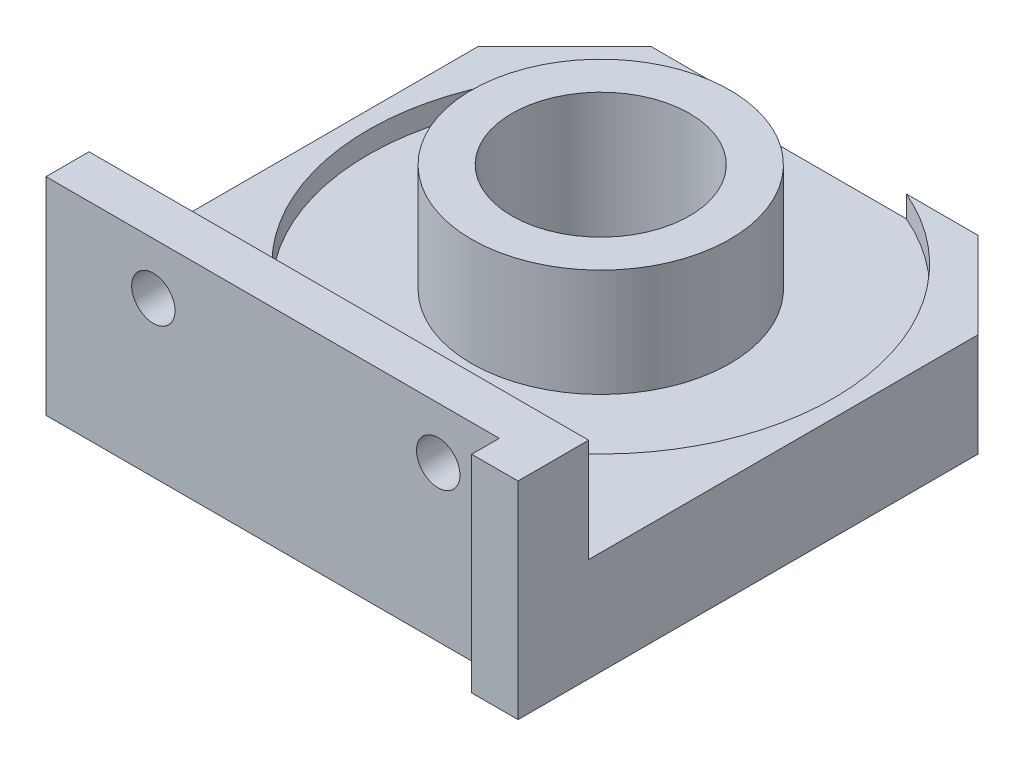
ISO-10303-21;
HEADER;
FILE_DESCRIPTION(('STEP AP214'),'2;1');
FILE_NAME('part.step','',(''),(''),'','','');
FILE_SCHEMA(('AUTOMOTIVE_DESIGN { 1 0 10303 214 1 1 1 1 }'));
ENDSEC;
DATA;
#1=APPLICATION_CONTEXT('core data for automotive mechanical design processes');
#2=APPLICATION_PROTOCOL_DEFINITION('international standard','automotive_design',2000,#1);
#3=PRODUCT_CONTEXT('',#1,'mechanical');
#4=PRODUCT('Part','Part','',(#3));
#5=PRODUCT_RELATED_PRODUCT_CATEGORY('part','',(#4));
#6=PRODUCT_DEFINITION_FORMATION('','',#4);
#7=PRODUCT_DEFINITION_CONTEXT('part definition',#1,'design');
#8=PRODUCT_DEFINITION('design','',#6,#7);
#9=PRODUCT_DEFINITION_SHAPE('','',#8);
#10=(LENGTH_UNIT() NAMED_UNIT(*) SI_UNIT(.MILLI.,.METRE.));
#11=(NAMED_UNIT(*) PLANE_ANGLE_UNIT() SI_UNIT($,.RADIAN.));
#12=(NAMED_UNIT(*) SI_UNIT($,.STERADIAN.) SOLID_ANGLE_UNIT());
#13=UNCERTAINTY_MEASURE_WITH_UNIT(LENGTH_MEASURE(1.E-05),#10,'distance_accuracy_value','');
#14=(GEOMETRIC_REPRESENTATION_CONTEXT(3) GLOBAL_UNCERTAINTY_ASSIGNED_CONTEXT((#13)) GLOBAL_UNIT_ASSIGNED_CONTEXT((#10,
#11,#12)) REPRESENTATION_CONTEXT('',''));
#15=CARTESIAN_POINT('',(0.,0.,0.));
#16=DIRECTION('',(0.,0.,1.));
#17=DIRECTION('',(1.,0.,0.));
#18=AXIS2_PLACEMENT_3D('',#15,#16,#17);
#19=CARTESIAN_POINT('',(0.,-7.62,0.));
#20=DIRECTION('',(0.,1.,0.));
#21=DIRECTION('',(0.,0.,1.));
#22=AXIS2_PLACEMENT_3D('',#19,#20,#21);
#23=PLANE('',#22);
#24=DIRECTION('',(-1.,0.,0.));
#25=VECTOR('',#24,1.);
#26=CARTESIAN_POINT('',(0.,-7.62,-38.227));
#27=LINE('',#26,#25);
#28=CARTESIAN_POINT('',(-6.35000000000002,-7.62,-38.227));
#29=VERTEX_POINT('',#28);
#30=CARTESIAN_POINT('',(-30.48,-7.62,-38.227));
#31=VERTEX_POINT('',#30);
#32=EDGE_CURVE('E307',#29,#31,#27,.T.);
#33=ORIENTED_EDGE('',*,*,#32,.F.);
#34=DIRECTION('',(-0.707106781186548,0.,-0.707106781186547));
#35=VECTOR('',#34,1.);
#36=CARTESIAN_POINT('',(0.,-7.62,-31.877));
#37=LINE('',#36,#35);
#38=CARTESIAN_POINT('',(0.,-7.62,-31.877));
#39=VERTEX_POINT('',#38);
#40=EDGE_CURVE('E205',#29,#39,#37,.F.);
#41=ORIENTED_EDGE('',*,*,#40,.T.);
#42=DIRECTION('',(0.,0.,-1.));
#43=VECTOR('',#42,1.);
#44=CARTESIAN_POINT('',(0.,-7.62,0.));
#45=LINE('',#44,#43);
#46=CARTESIAN_POINT('',(0.,-7.62,2.032));
#47=VERTEX_POINT('',#46);
#48=EDGE_CURVE('E174',#47,#39,#45,.T.);
#49=ORIENTED_EDGE('',*,*,#48,.F.);
#50=DIRECTION('',(1.,0.,0.));
#51=VECTOR('',#50,1.);
#52=CARTESIAN_POINT('',(0.,-7.62,2.032));
#53=LINE('',#52,#51);
#54=CARTESIAN_POINT('',(-3.415,-7.62,2.032));
#55=VERTEX_POINT('',#54);
#56=EDGE_CURVE('E262',#55,#47,#53,.T.);
#57=ORIENTED_EDGE('',*,*,#56,.F.);
#58=DIRECTION('',(0.,0.,-1.));
#59=VECTOR('',#58,1.);
#60=CARTESIAN_POINT('',(-3.415,-7.62,2.032));
#61=LINE('',#60,#59);
#62=CARTESIAN_POINT('',(-3.415,-7.62,0.));
#63=VERTEX_POINT('',#62);
#64=EDGE_CURVE('E265',#55,#63,#61,.T.);
#65=ORIENTED_EDGE('',*,*,#64,.T.);
#66=DIRECTION('',(1.,0.,0.));
#67=VECTOR('',#66,1.);
#68=CARTESIAN_POINT('',(0.,-7.62,0.));
#69=LINE('',#68,#67);
#70=CARTESIAN_POINT('',(-36.83,-7.62,0.));
#71=VERTEX_POINT('',#70);
#72=EDGE_CURVE('E274',#71,#63,#69,.T.);
#73=ORIENTED_EDGE('',*,*,#72,.F.);
#74=DIRECTION('',(0.,0.,1.));
#75=VECTOR('',#74,1.);
#76=CARTESIAN_POINT('',(-36.83,-7.62,0.));
#77=LINE('',#76,#75);
#78=CARTESIAN_POINT('',(-36.83,-7.62,-31.8769999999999));
#79=VERTEX_POINT('',#78);
#80=EDGE_CURVE('E311',#79,#71,#77,.T.);
#81=ORIENTED_EDGE('',*,*,#80,.F.);
#82=DIRECTION('',(-0.707106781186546,0.,0.707106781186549));
#83=VECTOR('',#82,1.);
#84=CARTESIAN_POINT('',(-30.48,-7.62,-38.227));
#85=LINE('',#84,#83);
#86=EDGE_CURVE('E202',#79,#31,#85,.F.);
#87=ORIENTED_EDGE('',*,*,#86,.T.);
#88=EDGE_LOOP('',(#33,#41,#49,#57,#65,#73,#81,#87));
#89=FACE_BOUND('',#88,.T.);
#90=CARTESIAN_POINT('',(-18.415,-7.62,-22.48));
#91=DIRECTION('',(0.,1.,0.));
#92=DIRECTION('',(0.,0.,1.));
#93=AXIS2_PLACEMENT_3D('',#90,#91,#92);
#94=CIRCLE('',#93,10.795);
#95=CARTESIAN_POINT('',(-18.415,-7.62,-11.685));
#96=VERTEX_POINT('',#95);
#97=EDGE_CURVE('E209',#96,#96,#94,.F.);
#98=ORIENTED_EDGE('',*,*,#97,.F.);
#99=EDGE_LOOP('',(#98));
#100=FACE_BOUND('',#99,.T.);
#101=ADVANCED_FACE('F46',(#89,#100),#23,.F.);
#102=CARTESIAN_POINT('',(0.,0.,0.));
#103=DIRECTION('',(0.,1.,0.));
#104=DIRECTION('',(0.,0.,1.));
#105=AXIS2_PLACEMENT_3D('',#102,#103,#104);
#106=PLANE('',#105);
#107=CARTESIAN_POINT('',(-18.415,0.,-22.48));
#108=DIRECTION('',(0.,1.,0.));
#109=DIRECTION('',(0.,0.,1.));
#110=AXIS2_PLACEMENT_3D('',#107,#108,#109);
#111=CIRCLE('',#110,17.145);
#112=CARTESIAN_POINT('',(-25.1960777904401,0.,-38.227));
#113=VERTEX_POINT('',#112);
#114=CARTESIAN_POINT('',(-11.6339222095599,0.,-38.227));
#115=VERTEX_POINT('',#114);
#116=EDGE_CURVE('E147',#113,#115,#111,.T.);
#117=ORIENTED_EDGE('',*,*,#116,.F.);
#118=DIRECTION('',(-1.,0.,0.));
#119=VECTOR('',#118,1.);
#120=CARTESIAN_POINT('',(0.,0.,-38.227));
#121=LINE('',#120,#119);
#122=CARTESIAN_POINT('',(-30.48,0.,-38.227));
#123=VERTEX_POINT('',#122);
#124=EDGE_CURVE('E170',#113,#123,#121,.T.);
#125=ORIENTED_EDGE('',*,*,#124,.T.);
#126=DIRECTION('',(0.707106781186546,0.,-0.707106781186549));
#127=VECTOR('',#126,1.);
#128=CARTESIAN_POINT('',(-34.3535000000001,0.,-34.3534999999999));
#129=LINE('',#128,#127);
#130=CARTESIAN_POINT('',(-36.83,0.,-31.877));
#131=VERTEX_POINT('',#130);
#132=EDGE_CURVE('E190',#123,#131,#129,.F.);
#133=ORIENTED_EDGE('',*,*,#132,.T.);
#134=DIRECTION('',(0.,0.,1.));
#135=VECTOR('',#134,1.);
#136=CARTESIAN_POINT('',(-36.83,0.,0.));
#137=LINE('',#136,#135);
#138=CARTESIAN_POINT('',(-36.83,0.,-3.175));
#139=VERTEX_POINT('',#138);
#140=EDGE_CURVE('E169',#131,#139,#137,.T.);
#141=ORIENTED_EDGE('',*,*,#140,.T.);
#142=DIRECTION('',(-1.,0.,0.));
#143=VECTOR('',#142,1.);
#144=CARTESIAN_POINT('',(0.,0.,-3.175));
#145=LINE('',#144,#143);
#146=CARTESIAN_POINT('',(0.,0.,-3.175));
#147=VERTEX_POINT('',#146);
#148=EDGE_CURVE('E282',#147,#139,#145,.T.);
#149=ORIENTED_EDGE('',*,*,#148,.F.);
#150=DIRECTION('',(0.,0.,-1.));
#151=VECTOR('',#150,1.);
#152=CARTESIAN_POINT('',(0.,0.,0.));
#153=LINE('',#152,#151);
#154=CARTESIAN_POINT('',(0.,0.,-31.877));
#155=VERTEX_POINT('',#154);
#156=EDGE_CURVE('E177',#147,#155,#153,.T.);
#157=ORIENTED_EDGE('',*,*,#156,.T.);
#158=DIRECTION('',(0.707106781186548,0.,0.707106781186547));
#159=VECTOR('',#158,1.);
#160=CARTESIAN_POINT('',(15.9385,0.,-15.9385));
#161=LINE('',#160,#159);
#162=CARTESIAN_POINT('',(-6.35000000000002,0.,-38.227));
#163=VERTEX_POINT('',#162);
#164=EDGE_CURVE('E167',#155,#163,#161,.F.);
#165=ORIENTED_EDGE('',*,*,#164,.T.);
#166=EDGE_CURVE('E161',#163,#115,#121,.T.);
#167=ORIENTED_EDGE('',*,*,#166,.T.);
#168=EDGE_LOOP('',(#117,#125,#133,#141,#149,#157,#165,#167));
#169=FACE_BOUND('',#168,.T.);
#170=ADVANCED_FACE('F165',(#169),#106,.T.);
#171=CARTESIAN_POINT('',(0.,-7.62,0.));
#172=DIRECTION('',(1.,0.,0.));
#173=DIRECTION('',(0.,0.,-1.));
#174=AXIS2_PLACEMENT_3D('',#171,#172,#173);
#175=PLANE('',#174);
#176=ORIENTED_EDGE('',*,*,#48,.T.);
#177=DIRECTION('',(0.,1.,0.));
#178=VECTOR('',#177,1.);
#179=CARTESIAN_POINT('',(0.,-7.62,-31.877));
#180=LINE('',#179,#178);
#181=EDGE_CURVE('E188',#39,#155,#180,.T.);
#182=ORIENTED_EDGE('',*,*,#181,.T.);
#183=ORIENTED_EDGE('',*,*,#156,.F.);
#184=DIRECTION('',(0.,-1.,0.));
#185=VECTOR('',#184,1.);
#186=CARTESIAN_POINT('',(0.,7.62,-3.175));
#187=LINE('',#186,#185);
#188=CARTESIAN_POINT('',(0.,7.62,-3.175));
#189=VERTEX_POINT('',#188);
#190=EDGE_CURVE('E330',#189,#147,#187,.T.);
#191=ORIENTED_EDGE('',*,*,#190,.F.);
#192=DIRECTION('',(0.,0.,-1.));
#193=VECTOR('',#192,1.);
#194=CARTESIAN_POINT('',(0.,7.62,0.));
#195=LINE('',#194,#193);
#196=CARTESIAN_POINT('',(0.,7.62,2.032));
#197=VERTEX_POINT('',#196);
#198=EDGE_CURVE('E268',#197,#189,#195,.T.);
#199=ORIENTED_EDGE('',*,*,#198,.F.);
#200=DIRECTION('',(0.,1.,0.));
#201=VECTOR('',#200,1.);
#202=CARTESIAN_POINT('',(0.,7.62,2.032));
#203=LINE('',#202,#201);
#204=EDGE_CURVE('E255',#47,#197,#203,.T.);
#205=ORIENTED_EDGE('',*,*,#204,.F.);
#206=EDGE_LOOP('',(#176,#182,#183,#191,#199,#205));
#207=FACE_BOUND('',#206,.T.);
#208=ADVANCED_FACE('F325',(#207),#175,.T.);
#209=CARTESIAN_POINT('',(0.,-7.62,0.));
#210=DIRECTION('',(0.,0.,1.));
#211=DIRECTION('',(1.,0.,0.));
#212=AXIS2_PLACEMENT_3D('',#209,#210,#211);
#213=PLANE('',#212);
#214=CARTESIAN_POINT('',(-28.915,3.81,0.));
#215=DIRECTION('',(0.,0.,1.));
#216=DIRECTION('',(1.,0.,0.));
#217=AXIS2_PLACEMENT_3D('',#214,#215,#216);
#218=CIRCLE('',#217,1.59999999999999);
#219=CARTESIAN_POINT('',(-27.315,3.81,0.));
#220=VERTEX_POINT('',#219);
#221=EDGE_CURVE('E235',#220,#220,#218,.T.);
#222=ORIENTED_EDGE('',*,*,#221,.F.);
#223=EDGE_LOOP('',(#222));
#224=FACE_BOUND('',#223,.T.);
#225=CARTESIAN_POINT('',(-7.915,3.81,0.));
#226=DIRECTION('',(0.,0.,1.));
#227=DIRECTION('',(1.,0.,0.));
#228=AXIS2_PLACEMENT_3D('',#225,#226,#227);
#229=CIRCLE('',#228,1.59999999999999);
#230=CARTESIAN_POINT('',(-6.31500000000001,3.81,0.));
#231=VERTEX_POINT('',#230);
#232=EDGE_CURVE('E242',#231,#231,#229,.T.);
#233=ORIENTED_EDGE('',*,*,#232,.F.);
#234=EDGE_LOOP('',(#233));
#235=FACE_BOUND('',#234,.T.);
#236=DIRECTION('',(0.,-1.,0.));
#237=VECTOR('',#236,1.);
#238=CARTESIAN_POINT('',(-3.415,7.62,0.));
#239=LINE('',#238,#237);
#240=CARTESIAN_POINT('',(-3.415,7.62,0.));
#241=VERTEX_POINT('',#240);
#242=EDGE_CURVE('E254',#241,#63,#239,.T.);
#243=ORIENTED_EDGE('',*,*,#242,.F.);
#244=DIRECTION('',(1.,0.,0.));
#245=VECTOR('',#244,1.);
#246=CARTESIAN_POINT('',(0.,7.62,0.));
#247=LINE('',#246,#245);
#248=CARTESIAN_POINT('',(-36.83,7.62,0.));
#249=VERTEX_POINT('',#248);
#250=EDGE_CURVE('E333',#249,#241,#247,.T.);
#251=ORIENTED_EDGE('',*,*,#250,.F.);
#252=DIRECTION('',(0.,1.,0.));
#253=VECTOR('',#252,1.);
#254=CARTESIAN_POINT('',(-36.83,-7.62,0.));
#255=LINE('',#254,#253);
#256=EDGE_CURVE('E184',#71,#249,#255,.T.);
#257=ORIENTED_EDGE('',*,*,#256,.F.);
#258=ORIENTED_EDGE('',*,*,#72,.T.);
#259=EDGE_LOOP('',(#243,#251,#257,#258));
#260=FACE_BOUND('',#259,.T.);
#261=ADVANCED_FACE('F349',(#224,#235,#260),#213,.T.);
#262=CARTESIAN_POINT('',(-36.83,-7.62,0.));
#263=DIRECTION('',(-1.,0.,0.));
#264=DIRECTION('',(0.,0.,1.));
#265=AXIS2_PLACEMENT_3D('',#262,#263,#264);
#266=PLANE('',#265);
#267=CARTESIAN_POINT('',(-36.83,-3.81,-7.42949999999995));
#268=DIRECTION('',(-1.,0.,0.));
#269=DIRECTION('',(0.,0.,1.));
#270=AXIS2_PLACEMENT_3D('',#267,#268,#269);
#271=CIRCLE('',#270,1.25);
#272=CARTESIAN_POINT('',(-36.83,-3.81,-6.17949999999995));
#273=VERTEX_POINT('',#272);
#274=EDGE_CURVE('E214',#273,#273,#271,.T.);
#275=ORIENTED_EDGE('',*,*,#274,.F.);
#276=EDGE_LOOP('',(#275));
#277=FACE_BOUND('',#276,.T.);
#278=CARTESIAN_POINT('',(-36.83,-3.81,-26.4794999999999));
#279=DIRECTION('',(-1.,0.,0.));
#280=DIRECTION('',(0.,0.,1.));
#281=AXIS2_PLACEMENT_3D('',#278,#279,#280);
#282=CIRCLE('',#281,1.25);
#283=CARTESIAN_POINT('',(-36.83,-3.81,-25.2294999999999));
#284=VERTEX_POINT('',#283);
#285=EDGE_CURVE('E225',#284,#284,#282,.T.);
#286=ORIENTED_EDGE('',*,*,#285,.F.);
#287=EDGE_LOOP('',(#286));
#288=FACE_BOUND('',#287,.T.);
#289=ORIENTED_EDGE('',*,*,#140,.F.);
#290=DIRECTION('',(0.,-1.,0.));
#291=VECTOR('',#290,1.);
#292=CARTESIAN_POINT('',(-36.83,-7.62,-31.877));
#293=LINE('',#292,#291);
#294=EDGE_CURVE('E72',#131,#79,#293,.T.);
#295=ORIENTED_EDGE('',*,*,#294,.T.);
#296=ORIENTED_EDGE('',*,*,#80,.T.);
#297=ORIENTED_EDGE('',*,*,#256,.T.);
#298=DIRECTION('',(0.,0.,1.));
#299=VECTOR('',#298,1.);
#300=CARTESIAN_POINT('',(-36.83,7.62,0.));
#301=LINE('',#300,#299);
#302=CARTESIAN_POINT('',(-36.83,7.62,-3.175));
#303=VERTEX_POINT('',#302);
#304=EDGE_CURVE('E339',#303,#249,#301,.T.);
#305=ORIENTED_EDGE('',*,*,#304,.F.);
#306=DIRECTION('',(0.,-1.,0.));
#307=VECTOR('',#306,1.);
#308=CARTESIAN_POINT('',(-36.83,7.62,-3.175));
#309=LINE('',#308,#307);
#310=EDGE_CURVE('E298',#303,#139,#309,.T.);
#311=ORIENTED_EDGE('',*,*,#310,.T.);
#312=EDGE_LOOP('',(#289,#295,#296,#297,#305,#311));
#313=FACE_BOUND('',#312,.T.);
#314=ADVANCED_FACE('F347',(#277,#288,#313),#266,.T.);
#315=CARTESIAN_POINT('',(0.,-7.62,-38.227));
#316=DIRECTION('',(0.,0.,-1.));
#317=DIRECTION('',(-1.,0.,0.));
#318=AXIS2_PLACEMENT_3D('',#315,#316,#317);
#319=PLANE('',#318);
#320=DIRECTION('',(0.,1.,0.));
#321=VECTOR('',#320,1.);
#322=CARTESIAN_POINT('',(-25.1960777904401,-1.5875,-38.227));
#323=LINE('',#322,#321);
#324=CARTESIAN_POINT('',(-25.1960777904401,-1.5875,-38.227));
#325=VERTEX_POINT('',#324);
#326=EDGE_CURVE('E11',#325,#113,#323,.T.);
#327=ORIENTED_EDGE('',*,*,#326,.F.);
#328=DIRECTION('',(1.,0.,0.));
#329=VECTOR('',#328,1.);
#330=CARTESIAN_POINT('',(0.,-1.5875,-38.227));
#331=LINE('',#330,#329);
#332=CARTESIAN_POINT('',(-11.6339222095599,-1.5875,-38.227));
#333=VERTEX_POINT('',#332);
#334=EDGE_CURVE('E163',#325,#333,#331,.T.);
#335=ORIENTED_EDGE('',*,*,#334,.T.);
#336=DIRECTION('',(0.,1.,0.));
#337=VECTOR('',#336,1.);
#338=CARTESIAN_POINT('',(-11.6339222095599,-1.5875,-38.227));
#339=LINE('',#338,#337);
#340=EDGE_CURVE('E55',#115,#333,#339,.F.);
#341=ORIENTED_EDGE('',*,*,#340,.F.);
#342=ORIENTED_EDGE('',*,*,#166,.F.);
#343=DIRECTION('',(0.,-1.,0.));
#344=VECTOR('',#343,1.);
#345=CARTESIAN_POINT('',(-6.35000000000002,-7.62,-38.227));
#346=LINE('',#345,#344);
#347=EDGE_CURVE('E199',#163,#29,#346,.T.);
#348=ORIENTED_EDGE('',*,*,#347,.T.);
#349=ORIENTED_EDGE('',*,*,#32,.T.);
#350=DIRECTION('',(0.,1.,0.));
#351=VECTOR('',#350,1.);
#352=CARTESIAN_POINT('',(-30.48,-7.62,-38.227));
#353=LINE('',#352,#351);
#354=EDGE_CURVE('E195',#31,#123,#353,.T.);
#355=ORIENTED_EDGE('',*,*,#354,.T.);
#356=ORIENTED_EDGE('',*,*,#124,.F.);
#357=EDGE_LOOP('',(#327,#335,#341,#342,#348,#349,#355,#356));
#358=FACE_BOUND('',#357,.T.);
#359=ADVANCED_FACE('F160',(#358),#319,.T.);
#360=ORIENTED_EDGE('',*,*,#97,.T.);
#361=EDGE_LOOP('',(#360));
#362=FACE_BOUND('',#361,.T.);
#363=CARTESIAN_POINT('',(-18.415,-7.62,-22.48));
#364=DIRECTION('',(0.,1.,0.));
#365=DIRECTION('',(0.,0.,1.));
#366=AXIS2_PLACEMENT_3D('',#363,#364,#365);
#367=CIRCLE('',#366,6.54811999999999);
#368=CARTESIAN_POINT('',(-18.415,-7.62,-15.93188));
#369=VERTEX_POINT('',#368);
#370=EDGE_CURVE('E248',#369,#369,#367,.T.);
#371=ORIENTED_EDGE('',*,*,#370,.T.);
#372=EDGE_LOOP('',(#371));
#373=FACE_BOUND('',#372,.T.);
#374=ADVANCED_FACE('F356',(#362,#373),#23,.F.);
#375=CARTESIAN_POINT('',(0.,7.62,-3.175));
#376=DIRECTION('',(0.,0.,1.));
#377=DIRECTION('',(1.,0.,0.));
#378=AXIS2_PLACEMENT_3D('',#375,#376,#377);
#379=PLANE('',#378);
#380=CARTESIAN_POINT('',(-28.915,3.81,-3.175));
#381=DIRECTION('',(0.,0.,-1.));
#382=DIRECTION('',(-1.,0.,0.));
#383=AXIS2_PLACEMENT_3D('',#380,#381,#382);
#384=CIRCLE('',#383,1.59999999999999);
#385=CARTESIAN_POINT('',(-30.515,3.81,-3.175));
#386=VERTEX_POINT('',#385);
#387=EDGE_CURVE('E231',#386,#386,#384,.T.);
#388=ORIENTED_EDGE('',*,*,#387,.F.);
#389=EDGE_LOOP('',(#388));
#390=FACE_BOUND('',#389,.T.);
#391=CARTESIAN_POINT('',(-7.915,3.81,-3.175));
#392=DIRECTION('',(0.,0.,-1.));
#393=DIRECTION('',(-1.,0.,0.));
#394=AXIS2_PLACEMENT_3D('',#391,#392,#393);
#395=CIRCLE('',#394,1.59999999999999);
#396=CARTESIAN_POINT('',(-9.51499999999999,3.81,-3.175));
#397=VERTEX_POINT('',#396);
#398=EDGE_CURVE('E239',#397,#397,#395,.T.);
#399=ORIENTED_EDGE('',*,*,#398,.F.);
#400=EDGE_LOOP('',(#399));
#401=FACE_BOUND('',#400,.T.);
#402=ORIENTED_EDGE('',*,*,#148,.T.);
#403=ORIENTED_EDGE('',*,*,#310,.F.);
#404=DIRECTION('',(-1.,0.,0.));
#405=VECTOR('',#404,1.);
#406=CARTESIAN_POINT('',(0.,7.62,-3.175));
#407=LINE('',#406,#405);
#408=EDGE_CURVE('E295',#189,#303,#407,.T.);
#409=ORIENTED_EDGE('',*,*,#408,.F.);
#410=ORIENTED_EDGE('',*,*,#190,.T.);
#411=EDGE_LOOP('',(#402,#403,#409,#410));
#412=FACE_BOUND('',#411,.T.);
#413=ADVANCED_FACE('F346',(#390,#401,#412),#379,.F.);
#414=CARTESIAN_POINT('',(0.,7.62,0.));
#415=DIRECTION('',(0.,1.,0.));
#416=DIRECTION('',(0.,0.,1.));
#417=AXIS2_PLACEMENT_3D('',#414,#415,#416);
#418=PLANE('',#417);
#419=ORIENTED_EDGE('',*,*,#198,.T.);
#420=ORIENTED_EDGE('',*,*,#408,.T.);
#421=ORIENTED_EDGE('',*,*,#304,.T.);
#422=ORIENTED_EDGE('',*,*,#250,.T.);
#423=DIRECTION('',(0.,0.,-1.));
#424=VECTOR('',#423,1.);
#425=CARTESIAN_POINT('',(-3.415,7.62,2.032));
#426=LINE('',#425,#424);
#427=CARTESIAN_POINT('',(-3.415,7.62,2.032));
#428=VERTEX_POINT('',#427);
#429=EDGE_CURVE('E278',#428,#241,#426,.T.);
#430=ORIENTED_EDGE('',*,*,#429,.F.);
#431=DIRECTION('',(-1.,0.,0.));
#432=VECTOR('',#431,1.);
#433=CARTESIAN_POINT('',(0.,7.62,2.032));
#434=LINE('',#433,#432);
#435=EDGE_CURVE('E258',#197,#428,#434,.T.);
#436=ORIENTED_EDGE('',*,*,#435,.F.);
#437=EDGE_LOOP('',(#419,#420,#421,#422,#430,#436));
#438=FACE_BOUND('',#437,.T.);
#439=ADVANCED_FACE('F344',(#438),#418,.T.);
#440=CARTESIAN_POINT('',(-3.415,7.62,2.032));
#441=DIRECTION('',(1.,0.,0.));
#442=DIRECTION('',(0.,1.,0.));
#443=AXIS2_PLACEMENT_3D('',#440,#441,#442);
#444=PLANE('',#443);
#445=ORIENTED_EDGE('',*,*,#242,.T.);
#446=ORIENTED_EDGE('',*,*,#64,.F.);
#447=DIRECTION('',(0.,-1.,0.));
#448=VECTOR('',#447,1.);
#449=CARTESIAN_POINT('',(-3.415,7.62,2.032));
#450=LINE('',#449,#448);
#451=EDGE_CURVE('E260',#428,#55,#450,.T.);
#452=ORIENTED_EDGE('',*,*,#451,.F.);
#453=ORIENTED_EDGE('',*,*,#429,.T.);
#454=EDGE_LOOP('',(#445,#446,#452,#453));
#455=FACE_BOUND('',#454,.T.);
#456=ADVANCED_FACE('F437',(#455),#444,.F.);
#457=CARTESIAN_POINT('',(0.,0.,2.032));
#458=DIRECTION('',(0.,0.,-1.));
#459=DIRECTION('',(-1.,0.,0.));
#460=AXIS2_PLACEMENT_3D('',#457,#458,#459);
#461=PLANE('',#460);
#462=ORIENTED_EDGE('',*,*,#204,.T.);
#463=ORIENTED_EDGE('',*,*,#435,.T.);
#464=ORIENTED_EDGE('',*,*,#451,.T.);
#465=ORIENTED_EDGE('',*,*,#56,.T.);
#466=EDGE_LOOP('',(#462,#463,#464,#465));
#467=FACE_BOUND('',#466,.T.);
#468=ADVANCED_FACE('F398',(#467),#461,.F.);
#469=CARTESIAN_POINT('',(-18.415,6.35,-22.48));
#470=DIRECTION('',(0.,-1.,0.));
#471=DIRECTION('',(0.,0.,-1.));
#472=AXIS2_PLACEMENT_3D('',#469,#470,#471);
#473=CYLINDRICAL_SURFACE('',#472,9.525);
#474=CARTESIAN_POINT('',(-18.415,6.35,-22.48));
#475=DIRECTION('',(0.,1.,0.));
#476=DIRECTION('',(0.,0.,1.));
#477=AXIS2_PLACEMENT_3D('',#474,#475,#476);
#478=CIRCLE('',#477,9.525);
#479=CARTESIAN_POINT('',(-18.415,6.35,-12.955));
#480=VERTEX_POINT('',#479);
#481=EDGE_CURVE('E251',#480,#480,#478,.T.);
#482=ORIENTED_EDGE('',*,*,#481,.F.);
#483=EDGE_LOOP('',(#482));
#484=FACE_BOUND('',#483,.T.);
#485=CARTESIAN_POINT('',(-18.415,-1.5875,-22.48));
#486=DIRECTION('',(0.,1.,0.));
#487=DIRECTION('',(0.,0.,1.));
#488=AXIS2_PLACEMENT_3D('',#485,#486,#487);
#489=CIRCLE('',#488,9.525);
#490=CARTESIAN_POINT('',(-18.415,-1.5875,-12.955));
#491=VERTEX_POINT('',#490);
#492=EDGE_CURVE('E156',#491,#491,#489,.T.);
#493=ORIENTED_EDGE('',*,*,#492,.T.);
#494=EDGE_LOOP('',(#493));
#495=FACE_BOUND('',#494,.T.);
#496=ADVANCED_FACE('F392',(#484,#495),#473,.T.);
#497=CARTESIAN_POINT('',(-18.415,6.35,-22.48));
#498=DIRECTION('',(0.,1.,0.));
#499=DIRECTION('',(0.,0.,1.));
#500=AXIS2_PLACEMENT_3D('',#497,#498,#499);
#501=PLANE('',#500);
#502=CARTESIAN_POINT('',(-18.415,6.35,-22.48));
#503=DIRECTION('',(0.,1.,0.));
#504=DIRECTION('',(0.,0.,1.));
#505=AXIS2_PLACEMENT_3D('',#502,#503,#504);
#506=CIRCLE('',#505,6.54811999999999);
#507=CARTESIAN_POINT('',(-18.415,6.35,-15.93188));
#508=VERTEX_POINT('',#507);
#509=EDGE_CURVE('E245',#508,#508,#506,.T.);
#510=ORIENTED_EDGE('',*,*,#509,.F.);
#511=EDGE_LOOP('',(#510));
#512=FACE_BOUND('',#511,.T.);
#513=ORIENTED_EDGE('',*,*,#481,.T.);
#514=EDGE_LOOP('',(#513));
#515=FACE_BOUND('',#514,.T.);
#516=ADVANCED_FACE('F386',(#512,#515),#501,.T.);
#517=CARTESIAN_POINT('',(-18.415,6.35,-22.48));
#518=DIRECTION('',(0.,1.,0.));
#519=DIRECTION('',(0.,0.,1.));
#520=AXIS2_PLACEMENT_3D('',#517,#518,#519);
#521=CYLINDRICAL_SURFACE('',#520,6.54811999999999);
#522=ORIENTED_EDGE('',*,*,#370,.F.);
#523=EDGE_LOOP('',(#522));
#524=FACE_BOUND('',#523,.T.);
#525=ORIENTED_EDGE('',*,*,#509,.T.);
#526=EDGE_LOOP('',(#525));
#527=FACE_BOUND('',#526,.T.);
#528=ADVANCED_FACE('F382',(#524,#527),#521,.F.);
#529=CARTESIAN_POINT('',(-7.915,3.81,-3.175));
#530=DIRECTION('',(0.,0.,-1.));
#531=DIRECTION('',(-1.,0.,0.));
#532=AXIS2_PLACEMENT_3D('',#529,#530,#531);
#533=CYLINDRICAL_SURFACE('',#532,1.59999999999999);
#534=ORIENTED_EDGE('',*,*,#398,.T.);
#535=EDGE_LOOP('',(#534));
#536=FACE_BOUND('',#535,.T.);
#537=ORIENTED_EDGE('',*,*,#232,.T.);
#538=EDGE_LOOP('',(#537));
#539=FACE_BOUND('',#538,.T.);
#540=ADVANCED_FACE('F385',(#536,#539),#533,.F.);
#541=CARTESIAN_POINT('',(-28.915,3.81,-3.175));
#542=DIRECTION('',(0.,0.,-1.));
#543=DIRECTION('',(-1.,0.,0.));
#544=AXIS2_PLACEMENT_3D('',#541,#542,#543);
#545=CYLINDRICAL_SURFACE('',#544,1.59999999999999);
#546=ORIENTED_EDGE('',*,*,#387,.T.);
#547=EDGE_LOOP('',(#546));
#548=FACE_BOUND('',#547,.T.);
#549=ORIENTED_EDGE('',*,*,#221,.T.);
#550=EDGE_LOOP('',(#549));
#551=FACE_BOUND('',#550,.T.);
#552=ADVANCED_FACE('F427',(#548,#551),#545,.F.);
#553=CARTESIAN_POINT('',(0.,-7.62,-31.877));
#554=DIRECTION('',(-0.707106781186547,0.,0.707106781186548));
#555=DIRECTION('',(0.,1.,0.));
#556=AXIS2_PLACEMENT_3D('',#553,#554,#555);
#557=PLANE('',#556);
#558=ORIENTED_EDGE('',*,*,#40,.F.);
#559=ORIENTED_EDGE('',*,*,#347,.F.);
#560=ORIENTED_EDGE('',*,*,#164,.F.);
#561=ORIENTED_EDGE('',*,*,#181,.F.);
#562=EDGE_LOOP('',(#558,#559,#560,#561));
#563=FACE_BOUND('',#562,.T.);
#564=ADVANCED_FACE('F430',(#563),#557,.F.);
#565=CARTESIAN_POINT('',(-30.48,-7.62,-38.227));
#566=DIRECTION('',(0.707106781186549,0.,0.707106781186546));
#567=DIRECTION('',(0.,1.,0.));
#568=AXIS2_PLACEMENT_3D('',#565,#566,#567);
#569=PLANE('',#568);
#570=ORIENTED_EDGE('',*,*,#86,.F.);
#571=ORIENTED_EDGE('',*,*,#294,.F.);
#572=ORIENTED_EDGE('',*,*,#132,.F.);
#573=ORIENTED_EDGE('',*,*,#354,.F.);
#574=EDGE_LOOP('',(#570,#571,#572,#573));
#575=FACE_BOUND('',#574,.T.);
#576=ADVANCED_FACE('F48',(#575),#569,.F.);
#577=CARTESIAN_POINT('',(-29.33,-3.81,-26.4794999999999));
#578=DIRECTION('',(1.,0.,0.));
#579=DIRECTION('',(0.,0.,-1.));
#580=AXIS2_PLACEMENT_3D('',#577,#578,#579);
#581=PLANE('',#580);
#582=CARTESIAN_POINT('',(-29.33,-3.81,-26.4794999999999));
#583=DIRECTION('',(-1.,0.,0.));
#584=DIRECTION('',(0.,0.,1.));
#585=AXIS2_PLACEMENT_3D('',#582,#583,#584);
#586=CIRCLE('',#585,1.25);
#587=CARTESIAN_POINT('',(-29.33,-3.81,-25.2294999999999));
#588=VERTEX_POINT('',#587);
#589=EDGE_CURVE('E228',#588,#588,#586,.T.);
#590=ORIENTED_EDGE('',*,*,#589,.T.);
#591=EDGE_LOOP('',(#590));
#592=FACE_BOUND('',#591,.T.);
#593=ADVANCED_FACE('F422',(#592),#581,.F.);
#594=CARTESIAN_POINT('',(-36.83,-3.81,-26.4794999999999));
#595=DIRECTION('',(-1.,0.,0.));
#596=DIRECTION('',(0.,0.,1.));
#597=AXIS2_PLACEMENT_3D('',#594,#595,#596);
#598=CYLINDRICAL_SURFACE('',#597,1.25);
#599=ORIENTED_EDGE('',*,*,#589,.F.);
#600=EDGE_LOOP('',(#599));
#601=FACE_BOUND('',#600,.T.);
#602=ORIENTED_EDGE('',*,*,#285,.T.);
#603=EDGE_LOOP('',(#602));
#604=FACE_BOUND('',#603,.T.);
#605=ADVANCED_FACE('F418',(#601,#604),#598,.F.);
#606=CARTESIAN_POINT('',(-29.33,-3.81,-7.42949999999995));
#607=DIRECTION('',(1.,0.,0.));
#608=DIRECTION('',(0.,0.,-1.));
#609=AXIS2_PLACEMENT_3D('',#606,#607,#608);
#610=PLANE('',#609);
#611=CARTESIAN_POINT('',(-29.33,-3.81,-7.42949999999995));
#612=DIRECTION('',(-1.,0.,0.));
#613=DIRECTION('',(0.,0.,1.));
#614=AXIS2_PLACEMENT_3D('',#611,#612,#613);
#615=CIRCLE('',#614,1.25);
#616=CARTESIAN_POINT('',(-29.33,-3.81,-6.17949999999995));
#617=VERTEX_POINT('',#616);
#618=EDGE_CURVE('E218',#617,#617,#615,.T.);
#619=ORIENTED_EDGE('',*,*,#618,.T.);
#620=EDGE_LOOP('',(#619));
#621=FACE_BOUND('',#620,.T.);
#622=ADVANCED_FACE('F414',(#621),#610,.F.);
#623=CARTESIAN_POINT('',(-36.83,-3.81,-7.42949999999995));
#624=DIRECTION('',(-1.,0.,0.));
#625=DIRECTION('',(0.,0.,1.));
#626=AXIS2_PLACEMENT_3D('',#623,#624,#625);
#627=CYLINDRICAL_SURFACE('',#626,1.25);
#628=ORIENTED_EDGE('',*,*,#618,.F.);
#629=EDGE_LOOP('',(#628));
#630=FACE_BOUND('',#629,.T.);
#631=ORIENTED_EDGE('',*,*,#274,.T.);
#632=EDGE_LOOP('',(#631));
#633=FACE_BOUND('',#632,.T.);
#634=ADVANCED_FACE('F409',(#630,#633),#627,.F.);
#635=CARTESIAN_POINT('',(-18.415,-1.5875,-22.48));
#636=DIRECTION('',(0.,1.,0.));
#637=DIRECTION('',(0.,0.,1.));
#638=AXIS2_PLACEMENT_3D('',#635,#636,#637);
#639=CYLINDRICAL_SURFACE('',#638,17.145);
#640=ORIENTED_EDGE('',*,*,#326,.T.);
#641=ORIENTED_EDGE('',*,*,#116,.T.);
#642=ORIENTED_EDGE('',*,*,#340,.T.);
#643=CARTESIAN_POINT('',(-18.415,-1.5875,-22.48));
#644=DIRECTION('',(0.,1.,0.));
#645=DIRECTION('',(0.,0.,1.));
#646=AXIS2_PLACEMENT_3D('',#643,#644,#645);
#647=CIRCLE('',#646,17.145);
#648=EDGE_CURVE('E64',#325,#333,#647,.T.);
#649=ORIENTED_EDGE('',*,*,#648,.F.);
#650=EDGE_LOOP('',(#640,#641,#642,#649));
#651=FACE_BOUND('',#650,.T.);
#652=ADVANCED_FACE('F149',(#651),#639,.F.);
#653=CARTESIAN_POINT('',(-18.415,-1.5875,-22.48));
#654=DIRECTION('',(0.,1.,0.));
#655=DIRECTION('',(0.,0.,1.));
#656=AXIS2_PLACEMENT_3D('',#653,#654,#655);
#657=PLANE('',#656);
#658=ORIENTED_EDGE('',*,*,#492,.F.);
#659=EDGE_LOOP('',(#658));
#660=FACE_BOUND('',#659,.T.);
#661=ORIENTED_EDGE('',*,*,#648,.T.);
#662=ORIENTED_EDGE('',*,*,#334,.F.);
#663=EDGE_LOOP('',(#661,#662));
#664=FACE_BOUND('',#663,.T.);
#665=ADVANCED_FACE('F403',(#660,#664),#657,.T.);
#666=CLOSED_SHELL('',(#101,#170,#208,#261,#314,#359,#374,#413,#439,#456,#468,#496,#516,#528,
#540,#552,#564,#576,#593,#605,#622,#634,#652,#665));
#667=MANIFOLD_SOLID_BREP('B2',#666);
#668=ADVANCED_BREP_SHAPE_REPRESENTATION('',(#18,#667),#14);
#669=SHAPE_DEFINITION_REPRESENTATION(#9,#668);
ENDSEC;
END-ISO-10303-21;
